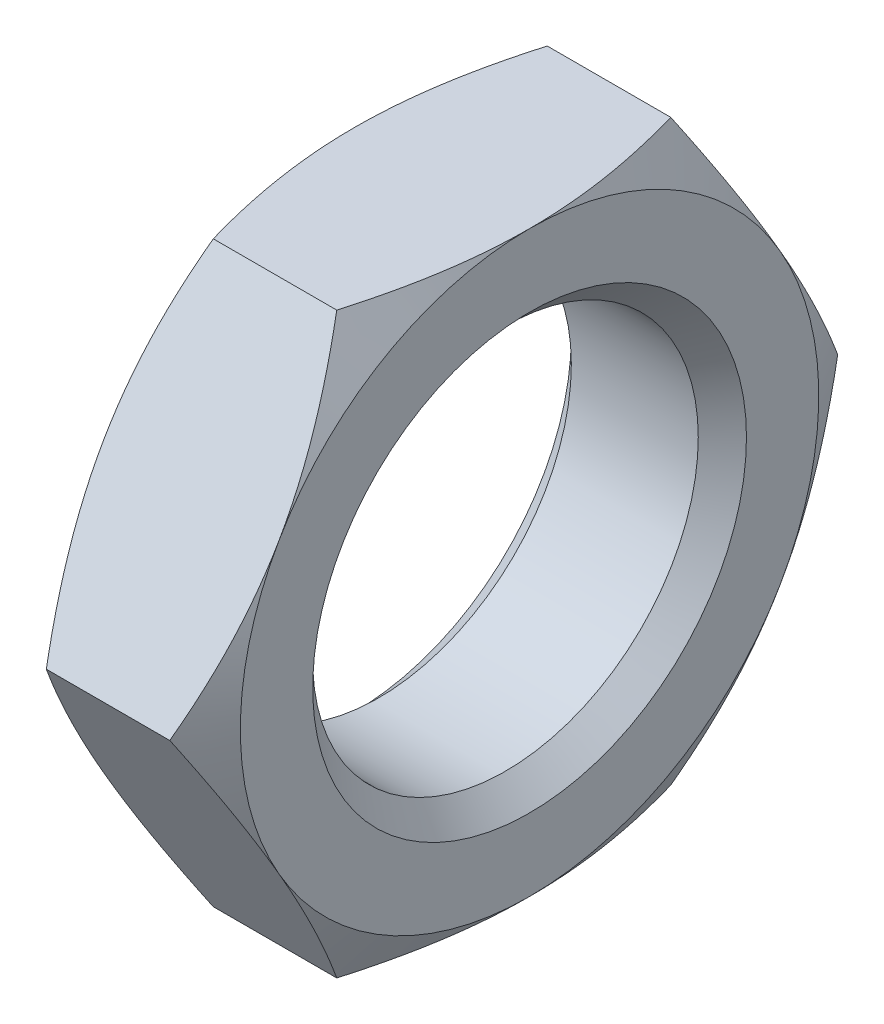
ISO-10303-21;
HEADER;
FILE_DESCRIPTION(('STEP AP214'),'2;1');
FILE_NAME('part.step','',(''),(''),'','','');
FILE_SCHEMA(('AUTOMOTIVE_DESIGN { 1 0 10303 214 1 1 1 1 }'));
ENDSEC;
DATA;
#1=APPLICATION_CONTEXT('core data for automotive mechanical design processes');
#2=APPLICATION_PROTOCOL_DEFINITION('international standard','automotive_design',2000,#1);
#3=PRODUCT_CONTEXT('',#1,'mechanical');
#4=PRODUCT('Part','Part','',(#3));
#5=PRODUCT_RELATED_PRODUCT_CATEGORY('part','',(#4));
#6=PRODUCT_DEFINITION_FORMATION('','',#4);
#7=PRODUCT_DEFINITION_CONTEXT('part definition',#1,'design');
#8=PRODUCT_DEFINITION('design','',#6,#7);
#9=PRODUCT_DEFINITION_SHAPE('','',#8);
#10=(LENGTH_UNIT() NAMED_UNIT(*) SI_UNIT(.MILLI.,.METRE.));
#11=(NAMED_UNIT(*) PLANE_ANGLE_UNIT() SI_UNIT($,.RADIAN.));
#12=(NAMED_UNIT(*) SI_UNIT($,.STERADIAN.) SOLID_ANGLE_UNIT());
#13=UNCERTAINTY_MEASURE_WITH_UNIT(LENGTH_MEASURE(1.E-05),#10,'distance_accuracy_value','');
#14=(GEOMETRIC_REPRESENTATION_CONTEXT(3) GLOBAL_UNCERTAINTY_ASSIGNED_CONTEXT((#13)) GLOBAL_UNIT_ASSIGNED_CONTEXT((#10,
#11,#12)) REPRESENTATION_CONTEXT('',''));
#15=CARTESIAN_POINT('',(0.,0.,0.));
#16=DIRECTION('',(0.,0.,1.));
#17=DIRECTION('',(1.,0.,0.));
#18=AXIS2_PLACEMENT_3D('',#15,#16,#17);
#19=CARTESIAN_POINT('',(10.9,18.,-10.3923048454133));
#20=DIRECTION('',(1.,0.,0.));
#21=DIRECTION('',(0.,0.,-1.));
#22=AXIS2_PLACEMENT_3D('',#19,#20,#21);
#23=PLANE('',#22);
#24=CARTESIAN_POINT('',(10.9,0.,0.));
#25=DIRECTION('',(1.,0.,0.));
#26=DIRECTION('',(0.,0.,-1.));
#27=AXIS2_PLACEMENT_3D('',#24,#25,#26);
#28=CIRCLE('',#27,13.5);
#29=CARTESIAN_POINT('',(10.9,0.,-13.5));
#30=VERTEX_POINT('',#29);
#31=EDGE_CURVE('E11',#30,#30,#28,.F.);
#32=ORIENTED_EDGE('',*,*,#31,.T.);
#33=EDGE_LOOP('',(#32));
#34=FACE_BOUND('',#33,.T.);
#35=CARTESIAN_POINT('',(10.9,0.,0.));
#36=DIRECTION('',(1.,0.,0.));
#37=DIRECTION('',(0.,0.,-1.));
#38=AXIS2_PLACEMENT_3D('',#35,#36,#37);
#39=CIRCLE('',#38,18.);
#40=CARTESIAN_POINT('',(10.9,-18.,0.));
#41=VERTEX_POINT('',#40);
#42=CARTESIAN_POINT('',(10.9,-9.,-15.5884572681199));
#43=VERTEX_POINT('',#42);
#44=EDGE_CURVE('E142',#41,#43,#39,.T.);
#45=ORIENTED_EDGE('',*,*,#44,.T.);
#46=CARTESIAN_POINT('',(10.9,9.00000000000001,-15.5884572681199));
#47=VERTEX_POINT('',#46);
#48=EDGE_CURVE('E130',#43,#47,#39,.T.);
#49=ORIENTED_EDGE('',*,*,#48,.T.);
#50=CARTESIAN_POINT('',(10.9,18.,0.));
#51=VERTEX_POINT('',#50);
#52=EDGE_CURVE('E144',#47,#51,#39,.T.);
#53=ORIENTED_EDGE('',*,*,#52,.T.);
#54=CARTESIAN_POINT('',(10.9,9.,15.5884572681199));
#55=VERTEX_POINT('',#54);
#56=EDGE_CURVE('E55',#51,#55,#39,.T.);
#57=ORIENTED_EDGE('',*,*,#56,.T.);
#58=CARTESIAN_POINT('',(10.9,-9.,15.5884572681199));
#59=VERTEX_POINT('',#58);
#60=EDGE_CURVE('E63',#55,#59,#39,.T.);
#61=ORIENTED_EDGE('',*,*,#60,.T.);
#62=EDGE_CURVE('E166',#59,#41,#39,.T.);
#63=ORIENTED_EDGE('',*,*,#62,.T.);
#64=EDGE_LOOP('',(#45,#49,#53,#57,#61,#63));
#65=FACE_BOUND('',#64,.T.);
#66=ADVANCED_FACE('F39',(#34,#65),#23,.T.);
#67=CARTESIAN_POINT('',(0.,18.,-10.3923048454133));
#68=DIRECTION('',(1.,0.,0.));
#69=DIRECTION('',(0.,0.,-1.));
#70=AXIS2_PLACEMENT_3D('',#67,#68,#69);
#71=PLANE('',#70);
#72=CARTESIAN_POINT('',(0.,0.,0.));
#73=DIRECTION('',(1.,0.,0.));
#74=DIRECTION('',(0.,0.,-1.));
#75=AXIS2_PLACEMENT_3D('',#72,#73,#74);
#76=CIRCLE('',#75,13.5);
#77=CARTESIAN_POINT('',(0.,0.,-13.5));
#78=VERTEX_POINT('',#77);
#79=EDGE_CURVE('E164',#78,#78,#76,.T.);
#80=ORIENTED_EDGE('',*,*,#79,.T.);
#81=EDGE_LOOP('',(#80));
#82=FACE_BOUND('',#81,.T.);
#83=CARTESIAN_POINT('',(0.,0.,0.));
#84=DIRECTION('',(1.,0.,0.));
#85=DIRECTION('',(0.,0.,-1.));
#86=AXIS2_PLACEMENT_3D('',#83,#84,#85);
#87=CIRCLE('',#86,18.);
#88=CARTESIAN_POINT('',(0.,-9.,-15.5884572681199));
#89=VERTEX_POINT('',#88);
#90=CARTESIAN_POINT('',(0.,9.00000000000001,-15.5884572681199));
#91=VERTEX_POINT('',#90);
#92=EDGE_CURVE('E173',#89,#91,#87,.T.);
#93=ORIENTED_EDGE('',*,*,#92,.F.);
#94=CARTESIAN_POINT('',(0.,-18.,0.));
#95=VERTEX_POINT('',#94);
#96=EDGE_CURVE('E317',#95,#89,#87,.T.);
#97=ORIENTED_EDGE('',*,*,#96,.F.);
#98=CARTESIAN_POINT('',(0.,-9.,15.5884572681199));
#99=VERTEX_POINT('',#98);
#100=EDGE_CURVE('E320',#99,#95,#87,.T.);
#101=ORIENTED_EDGE('',*,*,#100,.F.);
#102=CARTESIAN_POINT('',(0.,9.,15.5884572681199));
#103=VERTEX_POINT('',#102);
#104=EDGE_CURVE('E325',#103,#99,#87,.T.);
#105=ORIENTED_EDGE('',*,*,#104,.F.);
#106=CARTESIAN_POINT('',(0.,18.,0.));
#107=VERTEX_POINT('',#106);
#108=EDGE_CURVE('E178',#107,#103,#87,.T.);
#109=ORIENTED_EDGE('',*,*,#108,.F.);
#110=EDGE_CURVE('E174',#91,#107,#87,.T.);
#111=ORIENTED_EDGE('',*,*,#110,.F.);
#112=EDGE_LOOP('',(#93,#97,#101,#105,#109,#111));
#113=FACE_BOUND('',#112,.T.);
#114=ADVANCED_FACE('F318',(#82,#113),#71,.F.);
#115=CARTESIAN_POINT('',(10.9,0.,0.));
#116=DIRECTION('',(-1.,0.,0.));
#117=DIRECTION('',(0.,0.,1.));
#118=AXIS2_PLACEMENT_3D('',#115,#116,#117);
#119=CYLINDRICAL_SURFACE('',#118,12.);
#120=CARTESIAN_POINT('',(1.5,0.,0.));
#121=DIRECTION('',(1.,0.,0.));
#122=DIRECTION('',(0.,0.,-1.));
#123=AXIS2_PLACEMENT_3D('',#120,#121,#122);
#124=CIRCLE('',#123,12.);
#125=CARTESIAN_POINT('',(1.5,0.,-12.));
#126=VERTEX_POINT('',#125);
#127=EDGE_CURVE('E48',#126,#126,#124,.F.);
#128=ORIENTED_EDGE('',*,*,#127,.T.);
#129=EDGE_LOOP('',(#128));
#130=FACE_BOUND('',#129,.T.);
#131=CARTESIAN_POINT('',(9.40000000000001,0.,0.));
#132=DIRECTION('',(1.,0.,0.));
#133=DIRECTION('',(0.,0.,-1.));
#134=AXIS2_PLACEMENT_3D('',#131,#132,#133);
#135=CIRCLE('',#134,12.);
#136=CARTESIAN_POINT('',(9.40000000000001,0.,-12.));
#137=VERTEX_POINT('',#136);
#138=EDGE_CURVE('E409',#137,#137,#135,.T.);
#139=ORIENTED_EDGE('',*,*,#138,.T.);
#140=EDGE_LOOP('',(#139));
#141=FACE_BOUND('',#140,.T.);
#142=ADVANCED_FACE('F234',(#130,#141),#119,.F.);
#143=CARTESIAN_POINT('',(0.,0.,0.));
#144=DIRECTION('',(1.,0.,0.));
#145=DIRECTION('',(0.,0.,-1.));
#146=AXIS2_PLACEMENT_3D('',#143,#144,#145);
#147=CONICAL_SURFACE('',#146,18.,1.0471975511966);
#148=CARTESIAN_POINT('',(1.60776182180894,-18.0002,-10.3921893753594));
#149=CARTESIAN_POINT('',(1.47589336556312,-17.6045674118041,-10.6206079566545));
#150=CARTESIAN_POINT('',(1.35000889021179,-17.2073916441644,-10.8499174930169));
#151=CARTESIAN_POINT('',(1.11187123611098,-16.4098552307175,-11.310375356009));
#152=CARTESIAN_POINT('',(0.999622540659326,-16.0094935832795,-11.5415242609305));
#153=CARTESIAN_POINT('',(0.790265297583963,-15.2048116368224,-12.0061075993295));
#154=CARTESIAN_POINT('',(0.69319257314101,-14.8004842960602,-12.2395460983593));
#155=CARTESIAN_POINT('',(0.51627174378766,-13.9890201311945,-12.7080451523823));
#156=CARTESIAN_POINT('',(0.436422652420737,-13.5818834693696,-12.9431056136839));
#157=CARTESIAN_POINT('',(0.297345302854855,-12.7752328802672,-13.4088255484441));
#158=CARTESIAN_POINT('',(0.237656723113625,-12.3757788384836,-13.6394504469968));
#159=CARTESIAN_POINT('',(0.137572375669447,-11.5750403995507,-14.1017570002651));
#160=CARTESIAN_POINT('',(0.0971769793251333,-11.1737559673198,-14.3334386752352));
#161=CARTESIAN_POINT('',(0.0366989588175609,-10.370513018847,-14.7971912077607));
#162=CARTESIAN_POINT('',(0.0165921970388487,-9.96855587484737,-15.0292612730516));
#163=CARTESIAN_POINT('',(-0.00287614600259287,-9.16427056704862,-15.4936156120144));
#164=CARTESIAN_POINT('',(-0.00223836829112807,-8.76194241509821,-15.7258998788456));
#165=CARTESIAN_POINT('',(0.0183335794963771,-8.00978065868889,-16.1601606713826));
#166=CARTESIAN_POINT('',(0.0357591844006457,-7.65989346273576,-16.3621681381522));
#167=CARTESIAN_POINT('',(0.0859690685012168,-6.96095368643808,-16.765701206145));
#168=CARTESIAN_POINT('',(0.118753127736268,-6.61190109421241,-16.9672268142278));
#169=CARTESIAN_POINT('',(0.199111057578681,-5.91476277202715,-17.3697198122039));
#170=CARTESIAN_POINT('',(0.246698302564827,-5.56667820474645,-17.5706865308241));
#171=CARTESIAN_POINT('',(0.355822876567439,-4.87216610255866,-17.9716632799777));
#172=CARTESIAN_POINT('',(0.41736014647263,-4.5257385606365,-18.1716733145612));
#173=CARTESIAN_POINT('',(0.624462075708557,-3.47411308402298,-18.7788295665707));
#174=CARTESIAN_POINT('',(0.790677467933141,-2.771960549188,-19.1842175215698));
#175=CARTESIAN_POINT('',(1.16791817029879,-1.37812528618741,-19.9889486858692));
#176=CARTESIAN_POINT('',(1.3788548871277,-0.68642471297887,-20.3883021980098));
#177=CARTESIAN_POINT('',(1.60776182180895,0.000200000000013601,-20.7847251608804));
#178=B_SPLINE_CURVE_WITH_KNOTS('',3,(#148,#149,#150,#151,#152,#153,#154,#155,#156,#157,#158,
#159,#160,#161,#162,#163,#164,#165,#166,#167,#168,#169,#170,#171,#172,#173,#174,#175,#176,#177),
.UNSPECIFIED.,.F.,.F.,(4,2,2,2,2,2,2,2,2,2,2,2,2,2,4),(0.,1.42650335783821,2.85347447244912,
4.28376471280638,5.71397301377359,7.10888071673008,8.50381526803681,9.8970882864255,
11.2903182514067,12.5031974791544,13.7160593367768,14.9300201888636,16.1439758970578,
18.6253607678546,21.1018751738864),.UNSPECIFIED.);
#179=CARTESIAN_POINT('',(1.60769515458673,0.,-20.7846096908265));
#180=VERTEX_POINT('',#179);
#181=EDGE_CURVE('E333',#89,#180,#178,.T.);
#182=ORIENTED_EDGE('',*,*,#181,.F.);
#183=ORIENTED_EDGE('',*,*,#92,.T.);
#184=CARTESIAN_POINT('',(1.60776182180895,-0.000199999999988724,-20.7847251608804));
#185=CARTESIAN_POINT('',(1.47589336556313,0.3954325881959,-20.5563065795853));
#186=CARTESIAN_POINT('',(1.3500088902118,0.792608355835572,-20.3269970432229));
#187=CARTESIAN_POINT('',(1.11187123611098,1.59014476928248,-19.8665391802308));
#188=CARTESIAN_POINT('',(0.999622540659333,1.99050641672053,-19.6353902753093));
#189=CARTESIAN_POINT('',(0.790265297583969,2.79518836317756,-19.1708069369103));
#190=CARTESIAN_POINT('',(0.693192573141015,3.1995157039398,-18.9373684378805));
#191=CARTESIAN_POINT('',(0.516271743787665,4.01097986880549,-18.4688693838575));
#192=CARTESIAN_POINT('',(0.436422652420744,4.41811653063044,-18.2338089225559));
#193=CARTESIAN_POINT('',(0.297345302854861,5.22476711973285,-17.7680889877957));
#194=CARTESIAN_POINT('',(0.237656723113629,5.62422116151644,-17.537464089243));
#195=CARTESIAN_POINT('',(0.137572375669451,6.4249596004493,-17.0751575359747));
#196=CARTESIAN_POINT('',(0.0971769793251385,6.82624403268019,-16.8434758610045));
#197=CARTESIAN_POINT('',(0.0366989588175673,7.62948698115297,-16.3797233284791));
#198=CARTESIAN_POINT('',(0.0165921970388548,8.03144412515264,-16.1476532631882));
#199=CARTESIAN_POINT('',(-0.00287614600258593,8.83572943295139,-15.6832989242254));
#200=CARTESIAN_POINT('',(-0.00223836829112,9.2380575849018,-15.4510146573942));
#201=CARTESIAN_POINT('',(0.0183335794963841,9.99021934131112,-15.0167538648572));
#202=CARTESIAN_POINT('',(0.0357591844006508,10.3401065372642,-14.8147463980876));
#203=CARTESIAN_POINT('',(0.0859690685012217,11.0390463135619,-14.4112133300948));
#204=CARTESIAN_POINT('',(0.118753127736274,11.3880989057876,-14.209687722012));
#205=CARTESIAN_POINT('',(0.199111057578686,12.0852372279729,-13.8071947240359));
#206=CARTESIAN_POINT('',(0.24669830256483,12.4333217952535,-13.6062280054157));
#207=CARTESIAN_POINT('',(0.355822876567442,13.1278338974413,-13.2052512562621));
#208=CARTESIAN_POINT('',(0.417360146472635,13.4742614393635,-13.0052412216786));
#209=CARTESIAN_POINT('',(0.624462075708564,14.525886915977,-12.3980849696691));
#210=CARTESIAN_POINT('',(0.790677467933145,15.228039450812,-11.99269701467));
#211=CARTESIAN_POINT('',(1.16791817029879,16.6218747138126,-11.1879658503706));
#212=CARTESIAN_POINT('',(1.37885488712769,17.3135752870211,-10.78861233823));
#213=CARTESIAN_POINT('',(1.60776182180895,18.0002,-10.3921893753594));
#214=B_SPLINE_CURVE_WITH_KNOTS('',3,(#184,#185,#186,#187,#188,#189,#190,#191,#192,#193,#194,
#195,#196,#197,#198,#199,#200,#201,#202,#203,#204,#205,#206,#207,#208,#209,#210,#211,#212,#213),
.UNSPECIFIED.,.F.,.F.,(4,2,2,2,2,2,2,2,2,2,2,2,2,2,4),(0.,1.42650335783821,2.85347447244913,
4.28376471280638,5.71397301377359,7.10888071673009,8.50381526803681,9.89708828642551,
11.2903182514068,12.5031974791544,13.7160593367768,14.9300201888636,16.1439758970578,
18.6253607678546,21.1018751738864),.UNSPECIFIED.);
#215=EDGE_CURVE('E215',#180,#91,#214,.T.);
#216=ORIENTED_EDGE('',*,*,#215,.F.);
#217=EDGE_LOOP('',(#182,#183,#216));
#218=FACE_BOUND('',#217,.T.);
#219=ADVANCED_FACE('F194',(#218),#147,.T.);
#220=ORIENTED_EDGE('',*,*,#96,.T.);
#221=CARTESIAN_POINT('',(1.60769515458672,-18.,-10.3923048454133));
#222=VERTEX_POINT('',#221);
#223=EDGE_CURVE('E156',#222,#89,#178,.T.);
#224=ORIENTED_EDGE('',*,*,#223,.F.);
#225=CARTESIAN_POINT('',(8.87357235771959,-18.,-28.098435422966));
#226=CARTESIAN_POINT('',(8.68210794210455,-18.,-27.7045912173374));
#227=CARTESIAN_POINT('',(8.49158447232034,-18.,-27.3102897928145));
#228=CARTESIAN_POINT('',(8.11263216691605,-18.,-26.520677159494));
#229=CARTESIAN_POINT('',(7.92420335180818,-18.,-26.1253659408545));
#230=CARTESIAN_POINT('',(7.36232952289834,-18.,-24.9376718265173));
#231=CARTESIAN_POINT('',(6.99235254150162,-18.,-24.1436421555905));
#232=CARTESIAN_POINT('',(6.2618962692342,-18.,-22.5460962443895));
#233=CARTESIAN_POINT('',(5.90147807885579,-18.,-21.7425520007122));
#234=CARTESIAN_POINT('',(5.19514166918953,-18.,-20.1291373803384));
#235=CARTESIAN_POINT('',(4.8492227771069,-18.,-19.319267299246));
#236=CARTESIAN_POINT('',(4.16459139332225,-18.,-17.6650342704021));
#237=CARTESIAN_POINT('',(3.82649406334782,-18.,-16.820415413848));
#238=CARTESIAN_POINT('',(3.17544514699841,-18.,-15.1213581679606));
#239=CARTESIAN_POINT('',(2.86249635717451,-18.,-14.2669186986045));
#240=CARTESIAN_POINT('',(2.26983106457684,-18.,-12.5484293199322));
#241=CARTESIAN_POINT('',(1.99004883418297,-18.,-11.684402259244));
#242=CARTESIAN_POINT('',(1.4725565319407,-18.,-9.94387354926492));
#243=CARTESIAN_POINT('',(1.23483340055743,-18.,-9.06737586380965));
#244=CARTESIAN_POINT('',(0.91895937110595,-18.,-7.74555297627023));
#245=CARTESIAN_POINT('',(0.820672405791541,-18.,-7.3050116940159));
#246=CARTESIAN_POINT('',(0.638820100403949,-18.,-6.42088527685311));
#247=CARTESIAN_POINT('',(0.5552544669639,-18.,-5.97730020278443));
#248=CARTESIAN_POINT('',(0.404309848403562,-18.,-5.08738730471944));
#249=CARTESIAN_POINT('',(0.33693027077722,-18.,-4.64105958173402));
#250=CARTESIAN_POINT('',(0.219690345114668,-18.,-3.74609327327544));
#251=CARTESIAN_POINT('',(0.169829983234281,-18.,-3.29745468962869));
#252=CARTESIAN_POINT('',(0.0892589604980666,-18.,-2.40445658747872));
#253=CARTESIAN_POINT('',(0.0583028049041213,-18.,-1.96011935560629));
#254=CARTESIAN_POINT('',(0.0152182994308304,-18.,-1.07053417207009));
#255=CARTESIAN_POINT('',(0.00308963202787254,-18.,-0.625286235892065));
#256=CARTESIAN_POINT('',(-0.00205064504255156,-18.,0.265323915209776));
#257=CARTESIAN_POINT('',(0.00493777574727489,-18.,0.710686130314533));
#258=CARTESIAN_POINT('',(0.0378589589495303,-18.,1.60071501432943));
#259=CARTESIAN_POINT('',(0.0637925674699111,-18.,2.04538165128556));
#260=CARTESIAN_POINT('',(0.147891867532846,-18.,3.10855149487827));
#261=CARTESIAN_POINT('',(0.214740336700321,-18.,3.72638033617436));
#262=CARTESIAN_POINT('',(0.38141317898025,-18.,4.95757648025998));
#263=CARTESIAN_POINT('',(0.481241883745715,-18.,5.57094318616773));
#264=CARTESIAN_POINT('',(0.7103242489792,-18.,6.79258834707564));
#265=CARTESIAN_POINT('',(0.839600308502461,-18.,7.40086256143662));
#266=CARTESIAN_POINT('',(1.12362212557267,-18.,8.61137023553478));
#267=CARTESIAN_POINT('',(1.27836754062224,-18.,9.21360377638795));
#268=CARTESIAN_POINT('',(1.61323872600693,-18.,10.4253816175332));
#269=CARTESIAN_POINT('',(1.79385305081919,-18.,11.0347899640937));
#270=CARTESIAN_POINT('',(2.17411266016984,-18.,12.2476061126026));
#271=CARTESIAN_POINT('',(2.37375807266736,-18.,12.8510138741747));
#272=CARTESIAN_POINT('',(2.78887771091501,-18.,14.0521205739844));
#273=CARTESIAN_POINT('',(3.00434692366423,-18.,14.6498212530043));
#274=CARTESIAN_POINT('',(3.44854307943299,-18.,15.8402454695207));
#275=CARTESIAN_POINT('',(3.67726985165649,-18.,16.4329690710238));
#276=CARTESIAN_POINT('',(4.24066954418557,-18.,17.8531723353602));
#277=CARTESIAN_POINT('',(4.58073476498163,-18.,18.6785098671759));
#278=CARTESIAN_POINT('',(5.27795968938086,-18.,20.3219550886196));
#279=CARTESIAN_POINT('',(5.63512055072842,-18.,21.1400622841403));
#280=CARTESIAN_POINT('',(6.36304464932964,-18.,22.7704260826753));
#281=CARTESIAN_POINT('',(6.73381119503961,-18.,23.5826812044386));
#282=CARTESIAN_POINT('',(7.4861435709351,-18.,25.2021381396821));
#283=CARTESIAN_POINT('',(7.86770914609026,-18.,26.0093400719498));
#284=CARTESIAN_POINT('',(8.64003260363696,-18.,27.6204877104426));
#285=CARTESIAN_POINT('',(9.03080071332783,-18.,28.4244285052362));
#286=CARTESIAN_POINT('',(9.81950064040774,-18.,30.0287880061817));
#287=CARTESIAN_POINT('',(10.2174324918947,-18.,30.8292066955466));
#288=CARTESIAN_POINT('',(11.0191548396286,-18.,32.4269629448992));
#289=CARTESIAN_POINT('',(11.4229445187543,-18.,33.2243009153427));
#290=CARTESIAN_POINT('',(12.2354590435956,-18.,34.8164536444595));
#291=CARTESIAN_POINT('',(12.6441838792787,-18.,35.611268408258));
#292=CARTESIAN_POINT('',(13.8054584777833,-18.,37.8551159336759));
#293=CARTESIAN_POINT('',(14.5628414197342,-18.,39.3016472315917));
#294=CARTESIAN_POINT('',(16.0878841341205,-18.,42.1893408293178));
#295=CARTESIAN_POINT('',(16.8555443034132,-18.,43.6305029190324));
#296=CARTESIAN_POINT('',(18.3966717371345,-18.,46.5048259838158));
#297=CARTESIAN_POINT('',(19.1701183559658,-18.,47.9379980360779));
#298=CARTESIAN_POINT('',(20.3348325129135,-18.,50.085234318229));
#299=CARTESIAN_POINT('',(20.7238166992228,-18.,50.8005389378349));
#300=CARTESIAN_POINT('',(21.5031473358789,-18.,52.2304043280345));
#301=CARTESIAN_POINT('',(21.8934937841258,-18.,52.9449650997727));
#302=CARTESIAN_POINT('',(22.2844420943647,-18.,53.6591965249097));
#303=B_SPLINE_CURVE_WITH_KNOTS('',3,(#225,#226,#227,#228,#229,#230,#231,#232,#233,#234,#235,
#236,#237,#238,#239,#240,#241,#242,#243,#244,#245,#246,#247,#248,#249,#250,#251,#252,#253,#254,
#255,#256,#257,#258,#259,#260,#261,#262,#263,#264,#265,#266,#267,#268,#269,#270,#271,#272,#273,
#274,#275,#276,#277,#278,#279,#280,#281,#282,#283,#284,#285,#286,#287,#288,#289,#290,#291,#292,
#293,#294,#295,#296,#297,#298,#299,#300,#301,#302),.UNSPECIFIED.,.F.,.F.,(4,2,2,2,2,2,2,2,2,2,2,
2,2,2,2,2,2,2,2,2,2,2,2,2,2,2,2,2,2,2,2,2,2,2,2,2,2,2,4),(0.,1.31375067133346,2.62751419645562,
5.25542063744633,7.89732739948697,10.5391114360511,13.2681310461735,15.9974537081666,
18.7212737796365,21.4442466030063,22.7981573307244,24.1520410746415,25.5058752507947,
26.8597083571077,28.1955640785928,29.5313972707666,30.8672325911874,32.2031275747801,
34.0664050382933,35.9299273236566,37.7948718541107,39.659791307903,41.5662506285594,
43.4727227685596,45.378593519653,47.2844397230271,49.9621291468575,52.6400001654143,
55.3185267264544,57.9969900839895,60.6785855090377,63.3601937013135,66.0414313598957,
68.7226635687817,73.6210428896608,78.5196119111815,83.4052663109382,85.8479531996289,
88.2906363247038),.UNSPECIFIED.);
#304=EDGE_CURVE('E177',#95,#222,#303,.F.);
#305=ORIENTED_EDGE('',*,*,#304,.F.);
#306=EDGE_LOOP('',(#220,#224,#305));
#307=FACE_BOUND('',#306,.T.);
#308=ADVANCED_FACE('F352',(#307),#147,.T.);
#309=CARTESIAN_POINT('',(5.45,0.,0.));
#310=DIRECTION('',(-1.,0.,0.));
#311=DIRECTION('',(0.,0.,1.));
#312=AXIS2_PLACEMENT_3D('',#309,#310,#311);
#313=CONICAL_SURFACE('',#312,27.4396769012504,1.0471975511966);
#314=CARTESIAN_POINT('',(9.29223817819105,0.000200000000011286,-20.7847251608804));
#315=CARTESIAN_POINT('',(9.42410663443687,-0.395432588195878,-20.5563065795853));
#316=CARTESIAN_POINT('',(9.54999110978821,-0.792608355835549,-20.3269970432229));
#317=CARTESIAN_POINT('',(9.78812876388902,-1.59014476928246,-19.8665391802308));
#318=CARTESIAN_POINT('',(9.90037745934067,-1.9905064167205,-19.6353902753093));
#319=CARTESIAN_POINT('',(10.109734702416,-2.79518836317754,-19.1708069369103));
#320=CARTESIAN_POINT('',(10.206807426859,-3.19951570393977,-18.9373684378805));
#321=CARTESIAN_POINT('',(10.3837282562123,-4.01097986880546,-18.4688693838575));
#322=CARTESIAN_POINT('',(10.4635773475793,-4.41811653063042,-18.2338089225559));
#323=CARTESIAN_POINT('',(10.6026546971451,-5.22476711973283,-17.7680889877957));
#324=CARTESIAN_POINT('',(10.6623432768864,-5.62422116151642,-17.537464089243));
#325=CARTESIAN_POINT('',(10.7624276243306,-6.42495960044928,-17.0751575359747));
#326=CARTESIAN_POINT('',(10.8028230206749,-6.82624403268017,-16.8434758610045));
#327=CARTESIAN_POINT('',(10.8633010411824,-7.62948698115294,-16.3797233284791));
#328=CARTESIAN_POINT('',(10.8834078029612,-8.03144412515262,-16.1476532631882));
#329=CARTESIAN_POINT('',(10.9028761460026,-8.83572943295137,-15.6832989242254));
#330=CARTESIAN_POINT('',(10.9022383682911,-9.23805758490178,-15.4510146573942));
#331=CARTESIAN_POINT('',(10.8816664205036,-9.9902193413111,-15.0167538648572));
#332=CARTESIAN_POINT('',(10.8642408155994,-10.3401065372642,-14.8147463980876));
#333=CARTESIAN_POINT('',(10.8140309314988,-11.0390463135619,-14.4112133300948));
#334=CARTESIAN_POINT('',(10.7812468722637,-11.3880989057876,-14.209687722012));
#335=CARTESIAN_POINT('',(10.7008889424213,-12.0852372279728,-13.8071947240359));
#336=CARTESIAN_POINT('',(10.6533016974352,-12.4333217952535,-13.6062280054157));
#337=CARTESIAN_POINT('',(10.5441771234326,-13.1278338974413,-13.2052512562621));
#338=CARTESIAN_POINT('',(10.4826398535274,-13.4742614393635,-13.0052412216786));
#339=CARTESIAN_POINT('',(10.2755379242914,-14.525886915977,-12.3980849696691));
#340=CARTESIAN_POINT('',(10.1093225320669,-15.228039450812,-11.99269701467));
#341=CARTESIAN_POINT('',(9.73208182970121,-16.6218747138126,-11.1879658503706));
#342=CARTESIAN_POINT('',(9.52114511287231,-17.3135752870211,-10.78861233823));
#343=CARTESIAN_POINT('',(9.29223817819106,-18.0002,-10.3921893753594));
#344=B_SPLINE_CURVE_WITH_KNOTS('',3,(#314,#315,#316,#317,#318,#319,#320,#321,#322,#323,#324,
#325,#326,#327,#328,#329,#330,#331,#332,#333,#334,#335,#336,#337,#338,#339,#340,#341,#342,#343),
.UNSPECIFIED.,.F.,.F.,(4,2,2,2,2,2,2,2,2,2,2,2,2,2,4),(0.,1.42650335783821,2.85347447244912,
4.28376471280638,5.71397301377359,7.10888071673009,8.50381526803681,9.89708828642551,
11.2903182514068,12.5031974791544,13.7160593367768,14.9300201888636,16.1439758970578,
18.6253607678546,21.1018751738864),.UNSPECIFIED.);
#345=CARTESIAN_POINT('',(9.29230484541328,-18.,-10.3923048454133));
#346=VERTEX_POINT('',#345);
#347=EDGE_CURVE('E147',#43,#346,#344,.T.);
#348=ORIENTED_EDGE('',*,*,#347,.F.);
#349=ORIENTED_EDGE('',*,*,#44,.F.);
#350=CARTESIAN_POINT('',(2.02642764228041,-18.,-28.098435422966));
#351=CARTESIAN_POINT('',(2.21789205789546,-18.,-27.7045912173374));
#352=CARTESIAN_POINT('',(2.40841552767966,-18.,-27.3102897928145));
#353=CARTESIAN_POINT('',(2.78736783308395,-18.,-26.520677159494));
#354=CARTESIAN_POINT('',(2.97579664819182,-18.,-26.1253659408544));
#355=CARTESIAN_POINT('',(3.53767047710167,-18.,-24.9376718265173));
#356=CARTESIAN_POINT('',(3.90764745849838,-18.,-24.1436421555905));
#357=CARTESIAN_POINT('',(4.6381037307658,-18.,-22.5460962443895));
#358=CARTESIAN_POINT('',(4.99852192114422,-18.,-21.7425520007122));
#359=CARTESIAN_POINT('',(5.70485833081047,-18.,-20.1291373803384));
#360=CARTESIAN_POINT('',(6.0507772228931,-18.,-19.319267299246));
#361=CARTESIAN_POINT('',(6.73540860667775,-18.,-17.6650342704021));
#362=CARTESIAN_POINT('',(7.07350593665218,-18.,-16.820415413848));
#363=CARTESIAN_POINT('',(7.72455485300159,-18.,-15.1213581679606));
#364=CARTESIAN_POINT('',(8.03750364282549,-18.,-14.2669186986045));
#365=CARTESIAN_POINT('',(8.63016893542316,-18.,-12.5484293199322));
#366=CARTESIAN_POINT('',(8.90995116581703,-18.,-11.684402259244));
#367=CARTESIAN_POINT('',(9.4274434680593,-18.,-9.94387354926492));
#368=CARTESIAN_POINT('',(9.66516659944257,-18.,-9.06737586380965));
#369=CARTESIAN_POINT('',(9.98104062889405,-18.,-7.74555297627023));
#370=CARTESIAN_POINT('',(10.0793275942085,-18.,-7.3050116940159));
#371=CARTESIAN_POINT('',(10.2611798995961,-18.,-6.42088527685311));
#372=CARTESIAN_POINT('',(10.3447455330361,-18.,-5.97730020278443));
#373=CARTESIAN_POINT('',(10.4956901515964,-18.,-5.08738730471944));
#374=CARTESIAN_POINT('',(10.5630697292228,-18.,-4.64105958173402));
#375=CARTESIAN_POINT('',(10.6803096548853,-18.,-3.74609327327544));
#376=CARTESIAN_POINT('',(10.7301700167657,-18.,-3.29745468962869));
#377=CARTESIAN_POINT('',(10.8107410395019,-18.,-2.40445658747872));
#378=CARTESIAN_POINT('',(10.8416971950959,-18.,-1.96011935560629));
#379=CARTESIAN_POINT('',(10.8847817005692,-18.,-1.07053417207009));
#380=CARTESIAN_POINT('',(10.8969103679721,-18.,-0.625286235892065));
#381=CARTESIAN_POINT('',(10.9020506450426,-18.,0.265323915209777));
#382=CARTESIAN_POINT('',(10.8950622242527,-18.,0.710686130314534));
#383=CARTESIAN_POINT('',(10.8621410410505,-18.,1.60071501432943));
#384=CARTESIAN_POINT('',(10.8362074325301,-18.,2.04538165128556));
#385=CARTESIAN_POINT('',(10.7521081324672,-18.,3.10855149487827));
#386=CARTESIAN_POINT('',(10.6852596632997,-18.,3.72638033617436));
#387=CARTESIAN_POINT('',(10.5185868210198,-18.,4.95757648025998));
#388=CARTESIAN_POINT('',(10.4187581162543,-18.,5.57094318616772));
#389=CARTESIAN_POINT('',(10.1896757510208,-18.,6.79258834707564));
#390=CARTESIAN_POINT('',(10.0603996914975,-18.,7.40086256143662));
#391=CARTESIAN_POINT('',(9.77637787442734,-18.,8.61137023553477));
#392=CARTESIAN_POINT('',(9.62163245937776,-18.,9.21360377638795));
#393=CARTESIAN_POINT('',(9.28676127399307,-18.,10.4253816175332));
#394=CARTESIAN_POINT('',(9.10614694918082,-18.,11.0347899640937));
#395=CARTESIAN_POINT('',(8.72588733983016,-18.,12.2476061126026));
#396=CARTESIAN_POINT('',(8.52624192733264,-18.,12.8510138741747));
#397=CARTESIAN_POINT('',(8.111122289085,-18.,14.0521205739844));
#398=CARTESIAN_POINT('',(7.89565307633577,-18.,14.6498212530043));
#399=CARTESIAN_POINT('',(7.45145692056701,-18.,15.8402454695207));
#400=CARTESIAN_POINT('',(7.22273014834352,-18.,16.4329690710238));
#401=CARTESIAN_POINT('',(6.65933045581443,-18.,17.8531723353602));
#402=CARTESIAN_POINT('',(6.31926523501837,-18.,18.6785098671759));
#403=CARTESIAN_POINT('',(5.62204031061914,-18.,20.3219550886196));
#404=CARTESIAN_POINT('',(5.26487944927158,-18.,21.1400622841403));
#405=CARTESIAN_POINT('',(4.53695535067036,-18.,22.7704260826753));
#406=CARTESIAN_POINT('',(4.16618880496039,-18.,23.5826812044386));
#407=CARTESIAN_POINT('',(3.4138564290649,-18.,25.2021381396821));
#408=CARTESIAN_POINT('',(3.03229085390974,-18.,26.0093400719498));
#409=CARTESIAN_POINT('',(2.25996739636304,-18.,27.6204877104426));
#410=CARTESIAN_POINT('',(1.86919928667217,-18.,28.4244285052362));
#411=CARTESIAN_POINT('',(1.08049935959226,-18.,30.0287880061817));
#412=CARTESIAN_POINT('',(0.682567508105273,-18.,30.8292066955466));
#413=CARTESIAN_POINT('',(-0.119154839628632,-18.,32.4269629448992));
#414=CARTESIAN_POINT('',(-0.522944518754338,-18.,33.2243009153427));
#415=CARTESIAN_POINT('',(-1.33545904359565,-18.,34.8164536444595));
#416=CARTESIAN_POINT('',(-1.74418387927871,-18.,35.6112684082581));
#417=CARTESIAN_POINT('',(-2.90545847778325,-18.,37.8551159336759));
#418=CARTESIAN_POINT('',(-3.66284141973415,-18.,39.3016472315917));
#419=CARTESIAN_POINT('',(-5.18788413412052,-18.,42.1893408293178));
#420=CARTESIAN_POINT('',(-5.9555443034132,-18.,43.6305029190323));
#421=CARTESIAN_POINT('',(-7.49667173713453,-18.,46.5048259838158));
#422=CARTESIAN_POINT('',(-8.27011835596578,-18.,47.9379980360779));
#423=CARTESIAN_POINT('',(-9.43483251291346,-18.,50.085234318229));
#424=CARTESIAN_POINT('',(-9.82381669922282,-18.,50.8005389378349));
#425=CARTESIAN_POINT('',(-10.6031473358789,-18.,52.2304043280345));
#426=CARTESIAN_POINT('',(-10.9934937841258,-18.,52.9449650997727));
#427=CARTESIAN_POINT('',(-11.3844420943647,-18.,53.6591965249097));
#428=B_SPLINE_CURVE_WITH_KNOTS('',3,(#350,#351,#352,#353,#354,#355,#356,#357,#358,#359,#360,
#361,#362,#363,#364,#365,#366,#367,#368,#369,#370,#371,#372,#373,#374,#375,#376,#377,#378,#379,
#380,#381,#382,#383,#384,#385,#386,#387,#388,#389,#390,#391,#392,#393,#394,#395,#396,#397,#398,
#399,#400,#401,#402,#403,#404,#405,#406,#407,#408,#409,#410,#411,#412,#413,#414,#415,#416,#417,
#418,#419,#420,#421,#422,#423,#424,#425,#426,#427),.UNSPECIFIED.,.F.,.F.,(4,2,2,2,2,2,2,2,2,2,2,
2,2,2,2,2,2,2,2,2,2,2,2,2,2,2,2,2,2,2,2,2,2,2,2,2,2,2,4),(0.,1.31375067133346,2.62751419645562,
5.25542063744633,7.89732739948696,10.5391114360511,13.2681310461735,15.9974537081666,
18.7212737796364,21.4442466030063,22.7981573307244,24.1520410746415,25.5058752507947,
26.8597083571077,28.1955640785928,29.5313972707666,30.8672325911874,32.2031275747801,
34.0664050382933,35.9299273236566,37.7948718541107,39.659791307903,41.5662506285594,
43.4727227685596,45.378593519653,47.2844397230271,49.9621291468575,52.6400001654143,
55.3185267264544,57.9969900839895,60.6785855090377,63.3601937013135,66.0414313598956,
68.7226635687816,73.6210428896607,78.5196119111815,83.4052663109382,85.8479531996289,
88.2906363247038),.UNSPECIFIED.);
#429=EDGE_CURVE('E151',#346,#41,#428,.T.);
#430=ORIENTED_EDGE('',*,*,#429,.F.);
#431=EDGE_LOOP('',(#348,#349,#430));
#432=FACE_BOUND('',#431,.T.);
#433=ADVANCED_FACE('F148',(#432),#313,.T.);
#434=ORIENTED_EDGE('',*,*,#48,.F.);
#435=CARTESIAN_POINT('',(9.29230484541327,0.,-20.7846096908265));
#436=VERTEX_POINT('',#435);
#437=EDGE_CURVE('E134',#436,#43,#344,.T.);
#438=ORIENTED_EDGE('',*,*,#437,.F.);
#439=CARTESIAN_POINT('',(9.29223817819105,18.0002,-10.3921893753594));
#440=CARTESIAN_POINT('',(9.42410663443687,17.6045674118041,-10.6206079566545));
#441=CARTESIAN_POINT('',(9.54999110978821,17.2073916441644,-10.8499174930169));
#442=CARTESIAN_POINT('',(9.78812876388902,16.4098552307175,-11.310375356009));
#443=CARTESIAN_POINT('',(9.90037745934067,16.0094935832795,-11.5415242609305));
#444=CARTESIAN_POINT('',(10.109734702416,15.2048116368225,-12.0061075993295));
#445=CARTESIAN_POINT('',(10.206807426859,14.8004842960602,-12.2395460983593));
#446=CARTESIAN_POINT('',(10.3837282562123,13.9890201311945,-12.7080451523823));
#447=CARTESIAN_POINT('',(10.4635773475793,13.5818834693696,-12.9431056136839));
#448=CARTESIAN_POINT('',(10.6026546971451,12.7752328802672,-13.4088255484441));
#449=CARTESIAN_POINT('',(10.6623432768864,12.3757788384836,-13.6394504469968));
#450=CARTESIAN_POINT('',(10.7624276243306,11.5750403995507,-14.1017570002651));
#451=CARTESIAN_POINT('',(10.8028230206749,11.1737559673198,-14.3334386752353));
#452=CARTESIAN_POINT('',(10.8633010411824,10.370513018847,-14.7971912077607));
#453=CARTESIAN_POINT('',(10.8834078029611,9.96855587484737,-15.0292612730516));
#454=CARTESIAN_POINT('',(10.9028761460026,9.16427056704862,-15.4936156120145));
#455=CARTESIAN_POINT('',(10.9022383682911,8.76194241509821,-15.7258998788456));
#456=CARTESIAN_POINT('',(10.8816664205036,8.00978065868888,-16.1601606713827));
#457=CARTESIAN_POINT('',(10.8642408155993,7.65989346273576,-16.3621681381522));
#458=CARTESIAN_POINT('',(10.8140309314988,6.96095368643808,-16.765701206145));
#459=CARTESIAN_POINT('',(10.7812468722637,6.61190109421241,-16.9672268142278));
#460=CARTESIAN_POINT('',(10.7008889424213,5.91476277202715,-17.3697198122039));
#461=CARTESIAN_POINT('',(10.6533016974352,5.56667820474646,-17.5706865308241));
#462=CARTESIAN_POINT('',(10.5441771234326,4.87216610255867,-17.9716632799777));
#463=CARTESIAN_POINT('',(10.4826398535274,4.52573856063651,-18.1716733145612));
#464=CARTESIAN_POINT('',(10.2755379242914,3.47411308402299,-18.7788295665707));
#465=CARTESIAN_POINT('',(10.1093225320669,2.77196054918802,-19.1842175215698));
#466=CARTESIAN_POINT('',(9.7320818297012,1.37812528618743,-19.9889486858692));
#467=CARTESIAN_POINT('',(9.5211451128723,0.686424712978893,-20.3883021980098));
#468=CARTESIAN_POINT('',(9.29223817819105,-0.000199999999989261,-20.7847251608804));
#469=B_SPLINE_CURVE_WITH_KNOTS('',3,(#439,#440,#441,#442,#443,#444,#445,#446,#447,#448,#449,
#450,#451,#452,#453,#454,#455,#456,#457,#458,#459,#460,#461,#462,#463,#464,#465,#466,#467,#468),
.UNSPECIFIED.,.F.,.F.,(4,2,2,2,2,2,2,2,2,2,2,2,2,2,4),(0.,1.42650335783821,2.85347447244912,
4.28376471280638,5.71397301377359,7.10888071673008,8.50381526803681,9.8970882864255,
11.2903182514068,12.5031974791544,13.7160593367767,14.9300201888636,16.1439758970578,
18.6253607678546,21.1018751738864),.UNSPECIFIED.);
#470=EDGE_CURVE('E136',#47,#436,#469,.T.);
#471=ORIENTED_EDGE('',*,*,#470,.F.);
#472=EDGE_LOOP('',(#434,#438,#471));
#473=FACE_BOUND('',#472,.T.);
#474=ADVANCED_FACE('F132',(#473),#313,.T.);
#475=ORIENTED_EDGE('',*,*,#100,.T.);
#476=CARTESIAN_POINT('',(1.60769515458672,-18.,10.3923048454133));
#477=VERTEX_POINT('',#476);
#478=EDGE_CURVE('E187',#477,#95,#303,.F.);
#479=ORIENTED_EDGE('',*,*,#478,.F.);
#480=CARTESIAN_POINT('',(1.60776182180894,0.000200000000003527,20.7847251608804));
#481=CARTESIAN_POINT('',(1.47589336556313,-0.395432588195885,20.5563065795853));
#482=CARTESIAN_POINT('',(1.35000889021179,-0.792608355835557,20.3269970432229));
#483=CARTESIAN_POINT('',(1.11187123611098,-1.59014476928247,19.8665391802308));
#484=CARTESIAN_POINT('',(0.999622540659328,-1.99050641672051,19.6353902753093));
#485=CARTESIAN_POINT('',(0.790265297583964,-2.79518836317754,19.1708069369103));
#486=CARTESIAN_POINT('',(0.693192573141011,-3.19951570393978,18.9373684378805));
#487=CARTESIAN_POINT('',(0.516271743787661,-4.01097986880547,18.4688693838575));
#488=CARTESIAN_POINT('',(0.436422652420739,-4.41811653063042,18.2338089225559));
#489=CARTESIAN_POINT('',(0.297345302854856,-5.22476711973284,17.7680889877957));
#490=CARTESIAN_POINT('',(0.237656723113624,-5.62422116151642,17.537464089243));
#491=CARTESIAN_POINT('',(0.137572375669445,-6.42495960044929,17.0751575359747));
#492=CARTESIAN_POINT('',(0.0971769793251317,-6.82624403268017,16.8434758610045));
#493=CARTESIAN_POINT('',(0.0366989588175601,-7.62948698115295,16.3797233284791));
#494=CARTESIAN_POINT('',(0.0165921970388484,-8.03144412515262,16.1476532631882));
#495=CARTESIAN_POINT('',(-0.00287614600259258,-8.83572943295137,15.6832989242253));
#496=CARTESIAN_POINT('',(-0.00223836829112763,-9.23805758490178,15.4510146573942));
#497=CARTESIAN_POINT('',(0.0183335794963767,-9.99021934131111,15.0167538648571));
#498=CARTESIAN_POINT('',(0.0357591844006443,-10.3401065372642,14.8147463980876));
#499=CARTESIAN_POINT('',(0.0859690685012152,-11.0390463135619,14.4112133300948));
#500=CARTESIAN_POINT('',(0.118753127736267,-11.3880989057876,14.209687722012));
#501=CARTESIAN_POINT('',(0.199111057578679,-12.0852372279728,13.8071947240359));
#502=CARTESIAN_POINT('',(0.246698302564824,-12.4333217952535,13.6062280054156));
#503=CARTESIAN_POINT('',(0.355822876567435,-13.1278338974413,13.2052512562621));
#504=CARTESIAN_POINT('',(0.417360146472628,-13.4742614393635,13.0052412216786));
#505=CARTESIAN_POINT('',(0.624462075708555,-14.525886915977,12.3980849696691));
#506=CARTESIAN_POINT('',(0.790677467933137,-15.228039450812,11.99269701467));
#507=CARTESIAN_POINT('',(1.16791817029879,-16.6218747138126,11.1879658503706));
#508=CARTESIAN_POINT('',(1.37885488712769,-17.3135752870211,10.78861233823));
#509=CARTESIAN_POINT('',(1.60776182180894,-18.0002,10.3921893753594));
#510=B_SPLINE_CURVE_WITH_KNOTS('',3,(#480,#481,#482,#483,#484,#485,#486,#487,#488,#489,#490,
#491,#492,#493,#494,#495,#496,#497,#498,#499,#500,#501,#502,#503,#504,#505,#506,#507,#508,#509),
.UNSPECIFIED.,.F.,.F.,(4,2,2,2,2,2,2,2,2,2,2,2,2,2,4),(0.,1.42650335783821,2.85347447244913,
4.28376471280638,5.71397301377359,7.10888071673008,8.50381526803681,9.8970882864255,
11.2903182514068,12.5031974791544,13.7160593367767,14.9300201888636,16.1439758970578,
18.6253607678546,21.1018751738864),.UNSPECIFIED.);
#511=EDGE_CURVE('E188',#99,#477,#510,.T.);
#512=ORIENTED_EDGE('',*,*,#511,.F.);
#513=EDGE_LOOP('',(#475,#479,#512));
#514=FACE_BOUND('',#513,.T.);
#515=ADVANCED_FACE('F351',(#514),#147,.T.);
#516=CARTESIAN_POINT('',(9.29230484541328,-18.,10.3923048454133));
#517=VERTEX_POINT('',#516);
#518=EDGE_CURVE('E216',#41,#517,#428,.T.);
#519=ORIENTED_EDGE('',*,*,#518,.F.);
#520=ORIENTED_EDGE('',*,*,#62,.F.);
#521=CARTESIAN_POINT('',(9.29223817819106,-18.0002,10.3921893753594));
#522=CARTESIAN_POINT('',(9.42410663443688,-17.6045674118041,10.6206079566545));
#523=CARTESIAN_POINT('',(9.54999110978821,-17.2073916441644,10.8499174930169));
#524=CARTESIAN_POINT('',(9.78812876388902,-16.4098552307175,11.310375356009));
#525=CARTESIAN_POINT('',(9.90037745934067,-16.0094935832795,11.5415242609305));
#526=CARTESIAN_POINT('',(10.109734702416,-15.2048116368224,12.0061075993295));
#527=CARTESIAN_POINT('',(10.206807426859,-14.8004842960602,12.2395460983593));
#528=CARTESIAN_POINT('',(10.3837282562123,-13.9890201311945,12.7080451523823));
#529=CARTESIAN_POINT('',(10.4635773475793,-13.5818834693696,12.9431056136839));
#530=CARTESIAN_POINT('',(10.6026546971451,-12.7752328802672,13.4088255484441));
#531=CARTESIAN_POINT('',(10.6623432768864,-12.3757788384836,13.6394504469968));
#532=CARTESIAN_POINT('',(10.7624276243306,-11.5750403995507,14.1017570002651));
#533=CARTESIAN_POINT('',(10.8028230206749,-11.1737559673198,14.3334386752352));
#534=CARTESIAN_POINT('',(10.8633010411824,-10.370513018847,14.7971912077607));
#535=CARTESIAN_POINT('',(10.8834078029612,-9.96855587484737,15.0292612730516));
#536=CARTESIAN_POINT('',(10.9028761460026,-9.16427056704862,15.4936156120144));
#537=CARTESIAN_POINT('',(10.9022383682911,-8.76194241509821,15.7258998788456));
#538=CARTESIAN_POINT('',(10.8816664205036,-8.00978065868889,16.1601606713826));
#539=CARTESIAN_POINT('',(10.8642408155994,-7.65989346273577,16.3621681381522));
#540=CARTESIAN_POINT('',(10.8140309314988,-6.96095368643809,16.765701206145));
#541=CARTESIAN_POINT('',(10.7812468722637,-6.61190109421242,16.9672268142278));
#542=CARTESIAN_POINT('',(10.7008889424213,-5.91476277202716,17.3697198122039));
#543=CARTESIAN_POINT('',(10.6533016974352,-5.56667820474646,17.5706865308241));
#544=CARTESIAN_POINT('',(10.5441771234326,-4.87216610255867,17.9716632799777));
#545=CARTESIAN_POINT('',(10.4826398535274,-4.52573856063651,18.1716733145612));
#546=CARTESIAN_POINT('',(10.2755379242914,-3.47411308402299,18.7788295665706));
#547=CARTESIAN_POINT('',(10.1093225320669,-2.77196054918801,19.1842175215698));
#548=CARTESIAN_POINT('',(9.73208182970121,-1.37812528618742,19.9889486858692));
#549=CARTESIAN_POINT('',(9.52114511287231,-0.68642471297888,20.3883021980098));
#550=CARTESIAN_POINT('',(9.29223817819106,0.000200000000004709,20.7847251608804));
#551=B_SPLINE_CURVE_WITH_KNOTS('',3,(#521,#522,#523,#524,#525,#526,#527,#528,#529,#530,#531,
#532,#533,#534,#535,#536,#537,#538,#539,#540,#541,#542,#543,#544,#545,#546,#547,#548,#549,#550),
.UNSPECIFIED.,.F.,.F.,(4,2,2,2,2,2,2,2,2,2,2,2,2,2,4),(0.,1.42650335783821,2.85347447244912,
4.28376471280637,5.71397301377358,7.10888071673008,8.50381526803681,9.8970882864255,
11.2903182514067,12.5031974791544,13.7160593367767,14.9300201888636,16.1439758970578,
18.6253607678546,21.1018751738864),.UNSPECIFIED.);
#552=EDGE_CURVE('E247',#517,#59,#551,.T.);
#553=ORIENTED_EDGE('',*,*,#552,.F.);
#554=EDGE_LOOP('',(#519,#520,#553));
#555=FACE_BOUND('',#554,.T.);
#556=ADVANCED_FACE('F395',(#555),#313,.T.);
#557=ORIENTED_EDGE('',*,*,#104,.T.);
#558=CARTESIAN_POINT('',(1.60769515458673,0.,20.7846096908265));
#559=VERTEX_POINT('',#558);
#560=EDGE_CURVE('E288',#559,#99,#510,.T.);
#561=ORIENTED_EDGE('',*,*,#560,.F.);
#562=CARTESIAN_POINT('',(1.60776182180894,18.0002,10.3921893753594));
#563=CARTESIAN_POINT('',(1.47589336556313,17.6045674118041,10.6206079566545));
#564=CARTESIAN_POINT('',(1.35000889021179,17.2073916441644,10.8499174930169));
#565=CARTESIAN_POINT('',(1.11187123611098,16.4098552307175,11.310375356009));
#566=CARTESIAN_POINT('',(0.999622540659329,16.0094935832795,11.5415242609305));
#567=CARTESIAN_POINT('',(0.790265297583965,15.2048116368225,12.0061075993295));
#568=CARTESIAN_POINT('',(0.693192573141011,14.8004842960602,12.2395460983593));
#569=CARTESIAN_POINT('',(0.516271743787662,13.9890201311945,12.7080451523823));
#570=CARTESIAN_POINT('',(0.436422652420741,13.5818834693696,12.9431056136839));
#571=CARTESIAN_POINT('',(0.297345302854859,12.7752328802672,13.4088255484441));
#572=CARTESIAN_POINT('',(0.237656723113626,12.3757788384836,13.6394504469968));
#573=CARTESIAN_POINT('',(0.137572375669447,11.5750403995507,14.1017570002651));
#574=CARTESIAN_POINT('',(0.0971769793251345,11.1737559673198,14.3334386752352));
#575=CARTESIAN_POINT('',(0.0366989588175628,10.370513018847,14.7971912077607));
#576=CARTESIAN_POINT('',(0.0165921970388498,9.96855587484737,15.0292612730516));
#577=CARTESIAN_POINT('',(-0.00287614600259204,9.16427056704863,15.4936156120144));
#578=CARTESIAN_POINT('',(-0.00223836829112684,8.76194241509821,15.7258998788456));
#579=CARTESIAN_POINT('',(0.0183335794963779,8.00978065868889,16.1601606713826));
#580=CARTESIAN_POINT('',(0.0357591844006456,7.65989346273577,16.3621681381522));
#581=CARTESIAN_POINT('',(0.0859690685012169,6.96095368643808,16.765701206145));
#582=CARTESIAN_POINT('',(0.118753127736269,6.61190109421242,16.9672268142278));
#583=CARTESIAN_POINT('',(0.199111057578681,5.91476277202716,17.3697198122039));
#584=CARTESIAN_POINT('',(0.246698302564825,5.56667820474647,17.5706865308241));
#585=CARTESIAN_POINT('',(0.355822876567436,4.87216610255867,17.9716632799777));
#586=CARTESIAN_POINT('',(0.417360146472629,4.52573856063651,18.1716733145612));
#587=CARTESIAN_POINT('',(0.624462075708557,3.47411308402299,18.7788295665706));
#588=CARTESIAN_POINT('',(0.79067746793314,2.77196054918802,19.1842175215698));
#589=CARTESIAN_POINT('',(1.16791817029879,1.37812528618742,19.9889486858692));
#590=CARTESIAN_POINT('',(1.37885488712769,0.68642471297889,20.3883021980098));
#591=CARTESIAN_POINT('',(1.60776182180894,-0.000199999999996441,20.7847251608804));
#592=B_SPLINE_CURVE_WITH_KNOTS('',3,(#562,#563,#564,#565,#566,#567,#568,#569,#570,#571,#572,
#573,#574,#575,#576,#577,#578,#579,#580,#581,#582,#583,#584,#585,#586,#587,#588,#589,#590,#591),
.UNSPECIFIED.,.F.,.F.,(4,2,2,2,2,2,2,2,2,2,2,2,2,2,4),(0.,1.42650335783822,2.85347447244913,
4.28376471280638,5.71397301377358,7.10888071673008,8.50381526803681,9.8970882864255,
11.2903182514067,12.5031974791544,13.7160593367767,14.9300201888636,16.1439758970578,
18.6253607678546,21.1018751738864),.UNSPECIFIED.);
#593=EDGE_CURVE('E282',#103,#559,#592,.T.);
#594=ORIENTED_EDGE('',*,*,#593,.F.);
#595=EDGE_LOOP('',(#557,#561,#594));
#596=FACE_BOUND('',#595,.T.);
#597=ADVANCED_FACE('F232',(#596),#147,.T.);
#598=CARTESIAN_POINT('',(9.29230484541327,0.,20.7846096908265));
#599=VERTEX_POINT('',#598);
#600=EDGE_CURVE('E377',#59,#599,#551,.T.);
#601=ORIENTED_EDGE('',*,*,#600,.F.);
#602=ORIENTED_EDGE('',*,*,#60,.F.);
#603=CARTESIAN_POINT('',(9.29223817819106,-0.000199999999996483,20.7847251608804));
#604=CARTESIAN_POINT('',(9.42410663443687,0.395432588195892,20.5563065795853));
#605=CARTESIAN_POINT('',(9.54999110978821,0.792608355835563,20.3269970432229));
#606=CARTESIAN_POINT('',(9.78812876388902,1.59014476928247,19.8665391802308));
#607=CARTESIAN_POINT('',(9.90037745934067,1.99050641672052,19.6353902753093));
#608=CARTESIAN_POINT('',(10.109734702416,2.79518836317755,19.1708069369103));
#609=CARTESIAN_POINT('',(10.206807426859,3.19951570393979,18.9373684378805));
#610=CARTESIAN_POINT('',(10.3837282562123,4.01097986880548,18.4688693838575));
#611=CARTESIAN_POINT('',(10.4635773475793,4.41811653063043,18.2338089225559));
#612=CARTESIAN_POINT('',(10.6026546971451,5.22476711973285,17.7680889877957));
#613=CARTESIAN_POINT('',(10.6623432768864,5.62422116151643,17.537464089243));
#614=CARTESIAN_POINT('',(10.7624276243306,6.42495960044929,17.0751575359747));
#615=CARTESIAN_POINT('',(10.8028230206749,6.82624403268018,16.8434758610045));
#616=CARTESIAN_POINT('',(10.8633010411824,7.62948698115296,16.3797233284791));
#617=CARTESIAN_POINT('',(10.8834078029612,8.03144412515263,16.1476532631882));
#618=CARTESIAN_POINT('',(10.9028761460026,8.83572943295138,15.6832989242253));
#619=CARTESIAN_POINT('',(10.9022383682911,9.23805758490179,15.4510146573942));
#620=CARTESIAN_POINT('',(10.8816664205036,9.99021934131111,15.0167538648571));
#621=CARTESIAN_POINT('',(10.8642408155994,10.3401065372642,14.8147463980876));
#622=CARTESIAN_POINT('',(10.8140309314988,11.0390463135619,14.4112133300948));
#623=CARTESIAN_POINT('',(10.7812468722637,11.3880989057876,14.209687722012));
#624=CARTESIAN_POINT('',(10.7008889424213,12.0852372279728,13.8071947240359));
#625=CARTESIAN_POINT('',(10.6533016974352,12.4333217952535,13.6062280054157));
#626=CARTESIAN_POINT('',(10.5441771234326,13.1278338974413,13.2052512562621));
#627=CARTESIAN_POINT('',(10.4826398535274,13.4742614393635,13.0052412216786));
#628=CARTESIAN_POINT('',(10.2755379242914,14.525886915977,12.3980849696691));
#629=CARTESIAN_POINT('',(10.1093225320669,15.228039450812,11.99269701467));
#630=CARTESIAN_POINT('',(9.73208182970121,16.6218747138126,11.1879658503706));
#631=CARTESIAN_POINT('',(9.52114511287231,17.3135752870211,10.78861233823));
#632=CARTESIAN_POINT('',(9.29223817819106,18.0002,10.3921893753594));
#633=B_SPLINE_CURVE_WITH_KNOTS('',3,(#603,#604,#605,#606,#607,#608,#609,#610,#611,#612,#613,
#614,#615,#616,#617,#618,#619,#620,#621,#622,#623,#624,#625,#626,#627,#628,#629,#630,#631,#632),
.UNSPECIFIED.,.F.,.F.,(4,2,2,2,2,2,2,2,2,2,2,2,2,2,4),(0.,1.42650335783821,2.85347447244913,
4.28376471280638,5.71397301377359,7.10888071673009,8.50381526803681,9.8970882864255,
11.2903182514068,12.5031974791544,13.7160593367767,14.9300201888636,16.1439758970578,
18.6253607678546,21.1018751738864),.UNSPECIFIED.);
#634=EDGE_CURVE('E371',#599,#55,#633,.T.);
#635=ORIENTED_EDGE('',*,*,#634,.F.);
#636=EDGE_LOOP('',(#601,#602,#635));
#637=FACE_BOUND('',#636,.T.);
#638=ADVANCED_FACE('F227',(#637),#313,.T.);
#639=ORIENTED_EDGE('',*,*,#108,.T.);
#640=CARTESIAN_POINT('',(1.60769515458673,18.,10.3923048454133));
#641=VERTEX_POINT('',#640);
#642=EDGE_CURVE('E281',#641,#103,#592,.T.);
#643=ORIENTED_EDGE('',*,*,#642,.F.);
#644=CARTESIAN_POINT('',(8.8735723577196,18.,-28.098435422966));
#645=CARTESIAN_POINT('',(8.68210794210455,18.,-27.7045912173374));
#646=CARTESIAN_POINT('',(8.49158447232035,18.,-27.3102897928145));
#647=CARTESIAN_POINT('',(8.11263216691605,18.,-26.520677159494));
#648=CARTESIAN_POINT('',(7.92420335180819,18.,-26.1253659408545));
#649=CARTESIAN_POINT('',(7.36232952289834,18.,-24.9376718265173));
#650=CARTESIAN_POINT('',(6.99235254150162,18.,-24.1436421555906));
#651=CARTESIAN_POINT('',(6.26189626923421,18.,-22.5460962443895));
#652=CARTESIAN_POINT('',(5.90147807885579,18.,-21.7425520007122));
#653=CARTESIAN_POINT('',(5.19514166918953,18.,-20.1291373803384));
#654=CARTESIAN_POINT('',(4.8492227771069,18.,-19.319267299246));
#655=CARTESIAN_POINT('',(4.16459139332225,18.,-17.6650342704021));
#656=CARTESIAN_POINT('',(3.82649406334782,18.,-16.820415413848));
#657=CARTESIAN_POINT('',(3.17544514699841,18.,-15.1213581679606));
#658=CARTESIAN_POINT('',(2.86249635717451,18.,-14.2669186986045));
#659=CARTESIAN_POINT('',(2.26983106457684,18.,-12.5484293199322));
#660=CARTESIAN_POINT('',(1.99004883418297,18.,-11.684402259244));
#661=CARTESIAN_POINT('',(1.4725565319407,18.,-9.94387354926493));
#662=CARTESIAN_POINT('',(1.23483340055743,18.,-9.06737586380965));
#663=CARTESIAN_POINT('',(0.91895937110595,18.,-7.74555297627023));
#664=CARTESIAN_POINT('',(0.820672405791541,18.,-7.30501169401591));
#665=CARTESIAN_POINT('',(0.63882010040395,18.,-6.42088527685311));
#666=CARTESIAN_POINT('',(0.555254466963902,18.,-5.97730020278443));
#667=CARTESIAN_POINT('',(0.404309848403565,18.,-5.08738730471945));
#668=CARTESIAN_POINT('',(0.336930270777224,18.,-4.64105958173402));
#669=CARTESIAN_POINT('',(0.21969034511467,18.,-3.74609327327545));
#670=CARTESIAN_POINT('',(0.169829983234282,18.,-3.29745468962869));
#671=CARTESIAN_POINT('',(0.089258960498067,18.,-2.40445658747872));
#672=CARTESIAN_POINT('',(0.058302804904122,18.,-1.96011935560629));
#673=CARTESIAN_POINT('',(0.0152182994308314,18.,-1.07053417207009));
#674=CARTESIAN_POINT('',(0.00308963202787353,18.,-0.625286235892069));
#675=CARTESIAN_POINT('',(-0.00205064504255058,18.,0.265323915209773));
#676=CARTESIAN_POINT('',(0.00493777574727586,18.,0.71068613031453));
#677=CARTESIAN_POINT('',(0.0378589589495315,18.,1.60071501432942));
#678=CARTESIAN_POINT('',(0.0637925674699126,18.,2.04538165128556));
#679=CARTESIAN_POINT('',(0.147891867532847,18.,3.10855149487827));
#680=CARTESIAN_POINT('',(0.214740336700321,18.,3.72638033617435));
#681=CARTESIAN_POINT('',(0.381413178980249,18.,4.95757648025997));
#682=CARTESIAN_POINT('',(0.481241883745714,18.,5.57094318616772));
#683=CARTESIAN_POINT('',(0.7103242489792,18.,6.79258834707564));
#684=CARTESIAN_POINT('',(0.83960030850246,18.,7.40086256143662));
#685=CARTESIAN_POINT('',(1.12362212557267,18.,8.61137023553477));
#686=CARTESIAN_POINT('',(1.27836754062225,18.,9.21360377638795));
#687=CARTESIAN_POINT('',(1.61323872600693,18.,10.4253816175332));
#688=CARTESIAN_POINT('',(1.79385305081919,18.,11.0347899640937));
#689=CARTESIAN_POINT('',(2.17411266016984,18.,12.2476061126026));
#690=CARTESIAN_POINT('',(2.37375807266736,18.,12.8510138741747));
#691=CARTESIAN_POINT('',(2.788877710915,18.,14.0521205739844));
#692=CARTESIAN_POINT('',(3.00434692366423,18.,14.6498212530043));
#693=CARTESIAN_POINT('',(3.44854307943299,18.,15.8402454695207));
#694=CARTESIAN_POINT('',(3.67726985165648,18.,16.4329690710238));
#695=CARTESIAN_POINT('',(4.24066954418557,18.,17.8531723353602));
#696=CARTESIAN_POINT('',(4.58073476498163,18.,18.6785098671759));
#697=CARTESIAN_POINT('',(5.27795968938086,18.,20.3219550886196));
#698=CARTESIAN_POINT('',(5.63512055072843,18.,21.1400622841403));
#699=CARTESIAN_POINT('',(6.36304464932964,18.,22.7704260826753));
#700=CARTESIAN_POINT('',(6.73381119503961,18.,23.5826812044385));
#701=CARTESIAN_POINT('',(7.4861435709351,18.,25.2021381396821));
#702=CARTESIAN_POINT('',(7.86770914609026,18.,26.0093400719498));
#703=CARTESIAN_POINT('',(8.64003260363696,18.,27.6204877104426));
#704=CARTESIAN_POINT('',(9.03080071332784,18.,28.4244285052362));
#705=CARTESIAN_POINT('',(9.81950064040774,18.,30.0287880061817));
#706=CARTESIAN_POINT('',(10.2174324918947,18.,30.8292066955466));
#707=CARTESIAN_POINT('',(11.0191548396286,18.,32.4269629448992));
#708=CARTESIAN_POINT('',(11.4229445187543,18.,33.2243009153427));
#709=CARTESIAN_POINT('',(12.2354590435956,18.,34.8164536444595));
#710=CARTESIAN_POINT('',(12.6441838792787,18.,35.6112684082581));
#711=CARTESIAN_POINT('',(13.8054584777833,18.,37.8551159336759));
#712=CARTESIAN_POINT('',(14.5628414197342,18.,39.3016472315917));
#713=CARTESIAN_POINT('',(16.0878841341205,18.,42.1893408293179));
#714=CARTESIAN_POINT('',(16.8555443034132,18.,43.6305029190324));
#715=CARTESIAN_POINT('',(18.3966717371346,18.,46.5048259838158));
#716=CARTESIAN_POINT('',(19.1701183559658,18.,47.9379980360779));
#717=CARTESIAN_POINT('',(20.3348325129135,18.,50.085234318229));
#718=CARTESIAN_POINT('',(20.7238166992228,18.,50.8005389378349));
#719=CARTESIAN_POINT('',(21.5031473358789,18.,52.2304043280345));
#720=CARTESIAN_POINT('',(21.8934937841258,18.,52.9449650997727));
#721=CARTESIAN_POINT('',(22.2844420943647,18.,53.6591965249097));
#722=B_SPLINE_CURVE_WITH_KNOTS('',3,(#644,#645,#646,#647,#648,#649,#650,#651,#652,#653,#654,
#655,#656,#657,#658,#659,#660,#661,#662,#663,#664,#665,#666,#667,#668,#669,#670,#671,#672,#673,
#674,#675,#676,#677,#678,#679,#680,#681,#682,#683,#684,#685,#686,#687,#688,#689,#690,#691,#692,
#693,#694,#695,#696,#697,#698,#699,#700,#701,#702,#703,#704,#705,#706,#707,#708,#709,#710,#711,
#712,#713,#714,#715,#716,#717,#718,#719,#720,#721),.UNSPECIFIED.,.F.,.F.,(4,2,2,2,2,2,2,2,2,2,2,
2,2,2,2,2,2,2,2,2,2,2,2,2,2,2,2,2,2,2,2,2,2,2,2,2,2,2,4),(0.,1.31375067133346,2.62751419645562,
5.25542063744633,7.89732739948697,10.5391114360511,13.2681310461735,15.9974537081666,
18.7212737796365,21.4442466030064,22.7981573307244,24.1520410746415,25.5058752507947,
26.8597083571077,28.1955640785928,29.5313972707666,30.8672325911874,32.2031275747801,
34.0664050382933,35.9299273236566,37.7948718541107,39.659791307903,41.5662506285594,
43.4727227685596,45.378593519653,47.2844397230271,49.9621291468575,52.6400001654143,
55.3185267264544,57.9969900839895,60.6785855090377,63.3601937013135,66.0414313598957,
68.7226635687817,73.6210428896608,78.5196119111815,83.4052663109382,85.847953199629,
88.2906363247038),.UNSPECIFIED.);
#723=EDGE_CURVE('E274',#107,#641,#722,.T.);
#724=ORIENTED_EDGE('',*,*,#723,.F.);
#725=EDGE_LOOP('',(#639,#643,#724));
#726=FACE_BOUND('',#725,.T.);
#727=ADVANCED_FACE('F231',(#726),#147,.T.);
#728=ORIENTED_EDGE('',*,*,#56,.F.);
#729=CARTESIAN_POINT('',(2.0264276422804,18.,-28.098435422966));
#730=CARTESIAN_POINT('',(2.21789205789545,18.,-27.7045912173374));
#731=CARTESIAN_POINT('',(2.40841552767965,18.,-27.3102897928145));
#732=CARTESIAN_POINT('',(2.78736783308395,18.,-26.520677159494));
#733=CARTESIAN_POINT('',(2.97579664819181,18.,-26.1253659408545));
#734=CARTESIAN_POINT('',(3.53767047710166,18.,-24.9376718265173));
#735=CARTESIAN_POINT('',(3.90764745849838,18.,-24.1436421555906));
#736=CARTESIAN_POINT('',(4.63810373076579,18.,-22.5460962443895));
#737=CARTESIAN_POINT('',(4.99852192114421,18.,-21.7425520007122));
#738=CARTESIAN_POINT('',(5.70485833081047,18.,-20.1291373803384));
#739=CARTESIAN_POINT('',(6.0507772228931,18.,-19.319267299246));
#740=CARTESIAN_POINT('',(6.73540860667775,18.,-17.6650342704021));
#741=CARTESIAN_POINT('',(7.07350593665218,18.,-16.820415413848));
#742=CARTESIAN_POINT('',(7.72455485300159,18.,-15.1213581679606));
#743=CARTESIAN_POINT('',(8.03750364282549,18.,-14.2669186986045));
#744=CARTESIAN_POINT('',(8.63016893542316,18.,-12.5484293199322));
#745=CARTESIAN_POINT('',(8.90995116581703,18.,-11.684402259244));
#746=CARTESIAN_POINT('',(9.4274434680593,18.,-9.94387354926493));
#747=CARTESIAN_POINT('',(9.66516659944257,18.,-9.06737586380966));
#748=CARTESIAN_POINT('',(9.98104062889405,18.,-7.74555297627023));
#749=CARTESIAN_POINT('',(10.0793275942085,18.,-7.3050116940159));
#750=CARTESIAN_POINT('',(10.2611798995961,18.,-6.42088527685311));
#751=CARTESIAN_POINT('',(10.3447455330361,18.,-5.97730020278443));
#752=CARTESIAN_POINT('',(10.4956901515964,18.,-5.08738730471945));
#753=CARTESIAN_POINT('',(10.5630697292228,18.,-4.64105958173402));
#754=CARTESIAN_POINT('',(10.6803096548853,18.,-3.74609327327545));
#755=CARTESIAN_POINT('',(10.7301700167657,18.,-3.29745468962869));
#756=CARTESIAN_POINT('',(10.8107410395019,18.,-2.40445658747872));
#757=CARTESIAN_POINT('',(10.8416971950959,18.,-1.96011935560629));
#758=CARTESIAN_POINT('',(10.8847817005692,18.,-1.07053417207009));
#759=CARTESIAN_POINT('',(10.8969103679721,18.,-0.625286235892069));
#760=CARTESIAN_POINT('',(10.9020506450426,18.,0.265323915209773));
#761=CARTESIAN_POINT('',(10.8950622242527,18.,0.710686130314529));
#762=CARTESIAN_POINT('',(10.8621410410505,18.,1.60071501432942));
#763=CARTESIAN_POINT('',(10.8362074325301,18.,2.04538165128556));
#764=CARTESIAN_POINT('',(10.7521081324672,18.,3.10855149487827));
#765=CARTESIAN_POINT('',(10.6852596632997,18.,3.72638033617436));
#766=CARTESIAN_POINT('',(10.5185868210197,18.,4.95757648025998));
#767=CARTESIAN_POINT('',(10.4187581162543,18.,5.57094318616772));
#768=CARTESIAN_POINT('',(10.1896757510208,18.,6.79258834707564));
#769=CARTESIAN_POINT('',(10.0603996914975,18.,7.40086256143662));
#770=CARTESIAN_POINT('',(9.77637787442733,18.,8.61137023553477));
#771=CARTESIAN_POINT('',(9.62163245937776,18.,9.21360377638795));
#772=CARTESIAN_POINT('',(9.28676127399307,18.,10.4253816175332));
#773=CARTESIAN_POINT('',(9.10614694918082,18.,11.0347899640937));
#774=CARTESIAN_POINT('',(8.72588733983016,18.,12.2476061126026));
#775=CARTESIAN_POINT('',(8.52624192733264,18.,12.8510138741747));
#776=CARTESIAN_POINT('',(8.11112228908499,18.,14.0521205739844));
#777=CARTESIAN_POINT('',(7.89565307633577,18.,14.6498212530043));
#778=CARTESIAN_POINT('',(7.45145692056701,18.,15.8402454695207));
#779=CARTESIAN_POINT('',(7.22273014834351,18.,16.4329690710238));
#780=CARTESIAN_POINT('',(6.65933045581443,18.,17.8531723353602));
#781=CARTESIAN_POINT('',(6.31926523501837,18.,18.678509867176));
#782=CARTESIAN_POINT('',(5.62204031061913,18.,20.3219550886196));
#783=CARTESIAN_POINT('',(5.26487944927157,18.,21.1400622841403));
#784=CARTESIAN_POINT('',(4.53695535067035,18.,22.7704260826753));
#785=CARTESIAN_POINT('',(4.16618880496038,18.,23.5826812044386));
#786=CARTESIAN_POINT('',(3.4138564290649,18.,25.2021381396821));
#787=CARTESIAN_POINT('',(3.03229085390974,18.,26.0093400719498));
#788=CARTESIAN_POINT('',(2.25996739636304,18.,27.6204877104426));
#789=CARTESIAN_POINT('',(1.86919928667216,18.,28.4244285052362));
#790=CARTESIAN_POINT('',(1.08049935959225,18.,30.0287880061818));
#791=CARTESIAN_POINT('',(0.682567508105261,18.,30.8292066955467));
#792=CARTESIAN_POINT('',(-0.119154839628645,18.,32.4269629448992));
#793=CARTESIAN_POINT('',(-0.522944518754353,18.,33.2243009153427));
#794=CARTESIAN_POINT('',(-1.33545904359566,18.,34.8164536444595));
#795=CARTESIAN_POINT('',(-1.74418387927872,18.,35.6112684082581));
#796=CARTESIAN_POINT('',(-2.90545847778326,18.,37.855115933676));
#797=CARTESIAN_POINT('',(-3.66284141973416,18.,39.3016472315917));
#798=CARTESIAN_POINT('',(-5.18788413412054,18.,42.1893408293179));
#799=CARTESIAN_POINT('',(-5.95554430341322,18.,43.6305029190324));
#800=CARTESIAN_POINT('',(-7.49667173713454,18.,46.5048259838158));
#801=CARTESIAN_POINT('',(-8.27011835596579,18.,47.9379980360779));
#802=CARTESIAN_POINT('',(-9.43483251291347,18.,50.085234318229));
#803=CARTESIAN_POINT('',(-9.82381669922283,18.,50.8005389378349));
#804=CARTESIAN_POINT('',(-10.6031473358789,18.,52.2304043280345));
#805=CARTESIAN_POINT('',(-10.9934937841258,18.,52.9449650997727));
#806=CARTESIAN_POINT('',(-11.3844420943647,18.,53.6591965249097));
#807=B_SPLINE_CURVE_WITH_KNOTS('',3,(#729,#730,#731,#732,#733,#734,#735,#736,#737,#738,#739,
#740,#741,#742,#743,#744,#745,#746,#747,#748,#749,#750,#751,#752,#753,#754,#755,#756,#757,#758,
#759,#760,#761,#762,#763,#764,#765,#766,#767,#768,#769,#770,#771,#772,#773,#774,#775,#776,#777,
#778,#779,#780,#781,#782,#783,#784,#785,#786,#787,#788,#789,#790,#791,#792,#793,#794,#795,#796,
#797,#798,#799,#800,#801,#802,#803,#804,#805,#806),.UNSPECIFIED.,.F.,.F.,(4,2,2,2,2,2,2,2,2,2,2,
2,2,2,2,2,2,2,2,2,2,2,2,2,2,2,2,2,2,2,2,2,2,2,2,2,2,2,4),(0.,1.31375067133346,2.62751419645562,
5.25542063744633,7.89732739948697,10.5391114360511,13.2681310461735,15.9974537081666,
18.7212737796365,21.4442466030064,22.7981573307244,24.1520410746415,25.5058752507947,
26.8597083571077,28.1955640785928,29.5313972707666,30.8672325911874,32.2031275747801,
34.0664050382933,35.9299273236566,37.7948718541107,39.659791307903,41.5662506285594,
43.4727227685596,45.378593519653,47.2844397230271,49.9621291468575,52.6400001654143,
55.3185267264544,57.9969900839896,60.6785855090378,63.3601937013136,66.0414313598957,
68.7226635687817,73.6210428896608,78.5196119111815,83.4052663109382,85.847953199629,
88.2906363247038),.UNSPECIFIED.);
#808=CARTESIAN_POINT('',(9.29230484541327,18.,10.3923048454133));
#809=VERTEX_POINT('',#808);
#810=EDGE_CURVE('E259',#809,#51,#807,.F.);
#811=ORIENTED_EDGE('',*,*,#810,.F.);
#812=EDGE_CURVE('E260',#55,#809,#633,.T.);
#813=ORIENTED_EDGE('',*,*,#812,.F.);
#814=EDGE_LOOP('',(#728,#811,#813));
#815=FACE_BOUND('',#814,.T.);
#816=ADVANCED_FACE('F233',(#815),#313,.T.);
#817=ORIENTED_EDGE('',*,*,#110,.T.);
#818=CARTESIAN_POINT('',(1.60769515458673,18.,-10.3923048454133));
#819=VERTEX_POINT('',#818);
#820=EDGE_CURVE('E280',#819,#107,#722,.T.);
#821=ORIENTED_EDGE('',*,*,#820,.F.);
#822=EDGE_CURVE('E217',#91,#819,#214,.T.);
#823=ORIENTED_EDGE('',*,*,#822,.F.);
#824=EDGE_LOOP('',(#817,#821,#823));
#825=FACE_BOUND('',#824,.T.);
#826=ADVANCED_FACE('F336',(#825),#147,.T.);
#827=ORIENTED_EDGE('',*,*,#52,.F.);
#828=CARTESIAN_POINT('',(9.29230484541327,18.,-10.3923048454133));
#829=VERTEX_POINT('',#828);
#830=EDGE_CURVE('E383',#829,#47,#469,.T.);
#831=ORIENTED_EDGE('',*,*,#830,.F.);
#832=EDGE_CURVE('E252',#51,#829,#807,.F.);
#833=ORIENTED_EDGE('',*,*,#832,.F.);
#834=EDGE_LOOP('',(#827,#831,#833));
#835=FACE_BOUND('',#834,.T.);
#836=ADVANCED_FACE('F388',(#835),#313,.T.);
#837=CARTESIAN_POINT('',(10.9,-18.,-10.3923048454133));
#838=DIRECTION('',(0.,0.5,0.866025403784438));
#839=DIRECTION('',(0.,-0.866025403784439,0.5));
#840=AXIS2_PLACEMENT_3D('',#837,#838,#839);
#841=PLANE('',#840);
#842=DIRECTION('',(-1.,0.,0.));
#843=VECTOR('',#842,1.);
#844=CARTESIAN_POINT('',(10.9,0.,-20.7846096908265));
#845=LINE('',#844,#843);
#846=EDGE_CURVE('E162',#436,#180,#845,.T.);
#847=ORIENTED_EDGE('',*,*,#846,.F.);
#848=ORIENTED_EDGE('',*,*,#437,.T.);
#849=ORIENTED_EDGE('',*,*,#347,.T.);
#850=DIRECTION('',(-1.,0.,0.));
#851=VECTOR('',#850,1.);
#852=CARTESIAN_POINT('',(10.9,-18.,-10.3923048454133));
#853=LINE('',#852,#851);
#854=EDGE_CURVE('E369',#346,#222,#853,.T.);
#855=ORIENTED_EDGE('',*,*,#854,.T.);
#856=ORIENTED_EDGE('',*,*,#223,.T.);
#857=ORIENTED_EDGE('',*,*,#181,.T.);
#858=EDGE_LOOP('',(#847,#848,#849,#855,#856,#857));
#859=FACE_BOUND('',#858,.T.);
#860=ADVANCED_FACE('F159',(#859),#841,.F.);
#861=CARTESIAN_POINT('',(10.9,-18.,10.3923048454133));
#862=DIRECTION('',(0.,1.,0.));
#863=DIRECTION('',(0.,0.,1.));
#864=AXIS2_PLACEMENT_3D('',#861,#862,#863);
#865=PLANE('',#864);
#866=ORIENTED_EDGE('',*,*,#854,.F.);
#867=ORIENTED_EDGE('',*,*,#429,.T.);
#868=ORIENTED_EDGE('',*,*,#518,.T.);
#869=DIRECTION('',(-1.,0.,0.));
#870=VECTOR('',#869,1.);
#871=CARTESIAN_POINT('',(10.9,-18.,10.3923048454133));
#872=LINE('',#871,#870);
#873=EDGE_CURVE('E312',#517,#477,#872,.T.);
#874=ORIENTED_EDGE('',*,*,#873,.T.);
#875=ORIENTED_EDGE('',*,*,#478,.T.);
#876=ORIENTED_EDGE('',*,*,#304,.T.);
#877=EDGE_LOOP('',(#866,#867,#868,#874,#875,#876));
#878=FACE_BOUND('',#877,.T.);
#879=ADVANCED_FACE('F197',(#878),#865,.F.);
#880=CARTESIAN_POINT('',(10.9,0.,20.7846096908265));
#881=DIRECTION('',(0.,0.5,-0.866025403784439));
#882=DIRECTION('',(0.,0.866025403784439,0.5));
#883=AXIS2_PLACEMENT_3D('',#880,#881,#882);
#884=PLANE('',#883);
#885=ORIENTED_EDGE('',*,*,#873,.F.);
#886=ORIENTED_EDGE('',*,*,#552,.T.);
#887=ORIENTED_EDGE('',*,*,#600,.T.);
#888=DIRECTION('',(-1.,0.,0.));
#889=VECTOR('',#888,1.);
#890=CARTESIAN_POINT('',(10.9,0.,20.7846096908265));
#891=LINE('',#890,#889);
#892=EDGE_CURVE('E365',#599,#559,#891,.T.);
#893=ORIENTED_EDGE('',*,*,#892,.T.);
#894=ORIENTED_EDGE('',*,*,#560,.T.);
#895=ORIENTED_EDGE('',*,*,#511,.T.);
#896=EDGE_LOOP('',(#885,#886,#887,#893,#894,#895));
#897=FACE_BOUND('',#896,.T.);
#898=ADVANCED_FACE('F201',(#897),#884,.F.);
#899=CARTESIAN_POINT('',(10.9,18.,10.3923048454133));
#900=DIRECTION('',(0.,-0.5,-0.866025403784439));
#901=DIRECTION('',(0.,0.866025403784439,-0.5));
#902=AXIS2_PLACEMENT_3D('',#899,#900,#901);
#903=PLANE('',#902);
#904=ORIENTED_EDGE('',*,*,#892,.F.);
#905=ORIENTED_EDGE('',*,*,#634,.T.);
#906=ORIENTED_EDGE('',*,*,#812,.T.);
#907=DIRECTION('',(-1.,0.,0.));
#908=VECTOR('',#907,1.);
#909=CARTESIAN_POINT('',(10.9,18.,10.3923048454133));
#910=LINE('',#909,#908);
#911=EDGE_CURVE('E361',#809,#641,#910,.T.);
#912=ORIENTED_EDGE('',*,*,#911,.T.);
#913=ORIENTED_EDGE('',*,*,#642,.T.);
#914=ORIENTED_EDGE('',*,*,#593,.T.);
#915=EDGE_LOOP('',(#904,#905,#906,#912,#913,#914));
#916=FACE_BOUND('',#915,.T.);
#917=ADVANCED_FACE('F269',(#916),#903,.F.);
#918=CARTESIAN_POINT('',(10.9,18.,-10.3923048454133));
#919=DIRECTION('',(0.,-1.,0.));
#920=DIRECTION('',(0.,0.,-1.));
#921=AXIS2_PLACEMENT_3D('',#918,#919,#920);
#922=PLANE('',#921);
#923=ORIENTED_EDGE('',*,*,#911,.F.);
#924=ORIENTED_EDGE('',*,*,#810,.T.);
#925=ORIENTED_EDGE('',*,*,#832,.T.);
#926=DIRECTION('',(-1.,0.,0.));
#927=VECTOR('',#926,1.);
#928=CARTESIAN_POINT('',(10.9,18.,-10.3923048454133));
#929=LINE('',#928,#927);
#930=EDGE_CURVE('E354',#829,#819,#929,.T.);
#931=ORIENTED_EDGE('',*,*,#930,.T.);
#932=ORIENTED_EDGE('',*,*,#820,.T.);
#933=ORIENTED_EDGE('',*,*,#723,.T.);
#934=EDGE_LOOP('',(#923,#924,#925,#931,#932,#933));
#935=FACE_BOUND('',#934,.T.);
#936=ADVANCED_FACE('F265',(#935),#922,.F.);
#937=CARTESIAN_POINT('',(10.9,0.,-20.7846096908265));
#938=DIRECTION('',(0.,-0.5,0.866025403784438));
#939=DIRECTION('',(0.,-0.866025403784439,-0.5));
#940=AXIS2_PLACEMENT_3D('',#937,#938,#939);
#941=PLANE('',#940);
#942=ORIENTED_EDGE('',*,*,#930,.F.);
#943=ORIENTED_EDGE('',*,*,#830,.T.);
#944=ORIENTED_EDGE('',*,*,#470,.T.);
#945=ORIENTED_EDGE('',*,*,#846,.T.);
#946=ORIENTED_EDGE('',*,*,#215,.T.);
#947=ORIENTED_EDGE('',*,*,#822,.T.);
#948=EDGE_LOOP('',(#942,#943,#944,#945,#946,#947));
#949=FACE_BOUND('',#948,.T.);
#950=ADVANCED_FACE('F268',(#949),#941,.F.);
#951=CARTESIAN_POINT('',(0.,0.,0.));
#952=DIRECTION('',(-1.,0.,0.));
#953=DIRECTION('',(0.,0.,1.));
#954=AXIS2_PLACEMENT_3D('',#951,#952,#953);
#955=CONICAL_SURFACE('',#954,13.5,0.785398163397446);
#956=ORIENTED_EDGE('',*,*,#127,.F.);
#957=EDGE_LOOP('',(#956));
#958=FACE_BOUND('',#957,.T.);
#959=ORIENTED_EDGE('',*,*,#79,.F.);
#960=EDGE_LOOP('',(#959));
#961=FACE_BOUND('',#960,.T.);
#962=ADVANCED_FACE('F406',(#958,#961),#955,.F.);
#963=CARTESIAN_POINT('',(9.40000000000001,0.,0.));
#964=DIRECTION('',(1.,0.,0.));
#965=DIRECTION('',(0.,0.,-1.));
#966=AXIS2_PLACEMENT_3D('',#963,#964,#965);
#967=CONICAL_SURFACE('',#966,12.,0.785398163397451);
#968=ORIENTED_EDGE('',*,*,#31,.F.);
#969=EDGE_LOOP('',(#968));
#970=FACE_BOUND('',#969,.T.);
#971=ORIENTED_EDGE('',*,*,#138,.F.);
#972=EDGE_LOOP('',(#971));
#973=FACE_BOUND('',#972,.T.);
#974=ADVANCED_FACE('F41',(#970,#973),#967,.F.);
#975=CLOSED_SHELL('',(#66,#114,#142,#219,#308,#433,#474,#515,#556,#597,#638,#727,#816,#826,#836,
#860,#879,#898,#917,#936,#950,#962,#974));
#976=MANIFOLD_SOLID_BREP('B2',#975);
#977=ADVANCED_BREP_SHAPE_REPRESENTATION('',(#18,#976),#14);
#978=SHAPE_DEFINITION_REPRESENTATION(#9,#977);
ENDSEC;
END-ISO-10303-21;
